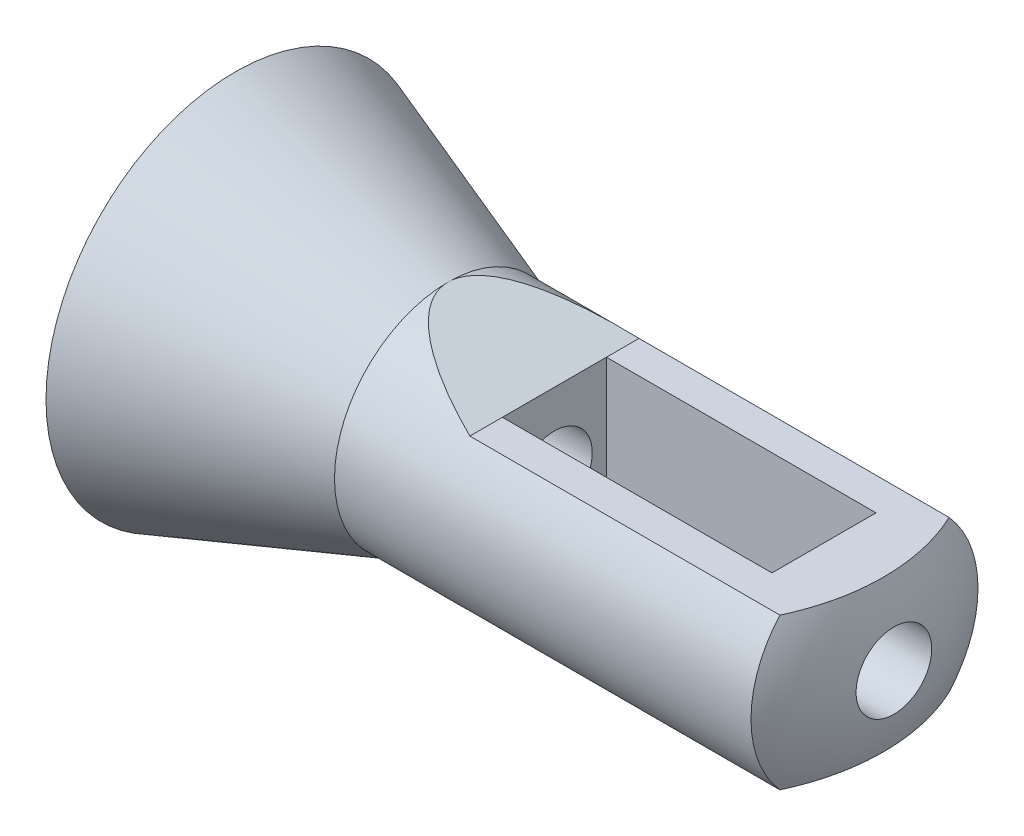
ISO-10303-21;
HEADER;
FILE_DESCRIPTION(('STEP AP214'),'2;1');
FILE_NAME('part.step','',(''),(''),'','','');
FILE_SCHEMA(('AUTOMOTIVE_DESIGN { 1 0 10303 214 1 1 1 1 }'));
ENDSEC;
DATA;
#1=APPLICATION_CONTEXT('core data for automotive mechanical design processes');
#2=APPLICATION_PROTOCOL_DEFINITION('international standard','automotive_design',2000,#1);
#3=PRODUCT_CONTEXT('',#1,'mechanical');
#4=PRODUCT('Part','Part','',(#3));
#5=PRODUCT_RELATED_PRODUCT_CATEGORY('part','',(#4));
#6=PRODUCT_DEFINITION_FORMATION('','',#4);
#7=PRODUCT_DEFINITION_CONTEXT('part definition',#1,'design');
#8=PRODUCT_DEFINITION('design','',#6,#7);
#9=PRODUCT_DEFINITION_SHAPE('','',#8);
#10=(LENGTH_UNIT() NAMED_UNIT(*) SI_UNIT(.MILLI.,.METRE.));
#11=(NAMED_UNIT(*) PLANE_ANGLE_UNIT() SI_UNIT($,.RADIAN.));
#12=(NAMED_UNIT(*) SI_UNIT($,.STERADIAN.) SOLID_ANGLE_UNIT());
#13=UNCERTAINTY_MEASURE_WITH_UNIT(LENGTH_MEASURE(1.E-05),#10,'distance_accuracy_value','');
#14=(GEOMETRIC_REPRESENTATION_CONTEXT(3) GLOBAL_UNCERTAINTY_ASSIGNED_CONTEXT((#13)) GLOBAL_UNIT_ASSIGNED_CONTEXT((#10,
#11,#12)) REPRESENTATION_CONTEXT('',''));
#15=CARTESIAN_POINT('',(0.,0.,0.));
#16=DIRECTION('',(0.,0.,1.));
#17=DIRECTION('',(1.,0.,0.));
#18=AXIS2_PLACEMENT_3D('',#15,#16,#17);
#19=CARTESIAN_POINT('',(0.,0.,0.));
#20=DIRECTION('',(-1.,0.,0.));
#21=DIRECTION('',(0.,0.,1.));
#22=AXIS2_PLACEMENT_3D('',#19,#20,#21);
#23=CYLINDRICAL_SURFACE('',#22,8.00000000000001);
#24=CARTESIAN_POINT('',(67.5,0.,0.));
#25=DIRECTION('',(-1.,0.,0.));
#26=DIRECTION('',(0.,0.,1.));
#27=AXIS2_PLACEMENT_3D('',#24,#25,#26);
#28=CIRCLE('',#27,8.00000000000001);
#29=CARTESIAN_POINT('',(67.5,0.,8.00000000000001));
#30=VERTEX_POINT('',#29);
#31=EDGE_CURVE('E135',#30,#30,#28,.T.);
#32=ORIENTED_EDGE('',*,*,#31,.F.);
#33=EDGE_LOOP('',(#32));
#34=FACE_BOUND('',#33,.T.);
#35=CARTESIAN_POINT('',(42.2401842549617,0.,0.));
#36=DIRECTION('',(-1.,0.,0.));
#37=DIRECTION('',(0.,0.,1.));
#38=AXIS2_PLACEMENT_3D('',#35,#36,#37);
#39=CIRCLE('',#38,8.00000000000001);
#40=CARTESIAN_POINT('',(42.2401842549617,0.,8.00000000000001));
#41=VERTEX_POINT('',#40);
#42=EDGE_CURVE('E142',#41,#41,#39,.T.);
#43=ORIENTED_EDGE('',*,*,#42,.T.);
#44=EDGE_LOOP('',(#43));
#45=FACE_BOUND('',#44,.T.);
#46=ADVANCED_FACE('F32',(#34,#45),#23,.F.);
#47=CARTESIAN_POINT('',(95.,0.,0.));
#48=DIRECTION('',(-1.,0.,0.));
#49=DIRECTION('',(0.,0.,-1.));
#50=AXIS2_PLACEMENT_3D('',#47,#48,#49);
#51=SPHERICAL_SURFACE('',#50,45.);
#52=CARTESIAN_POINT('',(95.,-16.,0.));
#53=DIRECTION('',(0.,1.,0.));
#54=DIRECTION('',(0.,0.,1.));
#55=AXIS2_PLACEMENT_3D('',#52,#53,#54);
#56=CIRCLE('',#55,42.0594816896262);
#57=CARTESIAN_POINT('',(133.065732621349,-16.,17.8885438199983));
#58=VERTEX_POINT('',#57);
#59=CARTESIAN_POINT('',(133.065732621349,-16.,-17.8885438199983));
#60=VERTEX_POINT('',#59);
#61=EDGE_CURVE('E186',#58,#60,#56,.T.);
#62=ORIENTED_EDGE('',*,*,#61,.T.);
#63=CARTESIAN_POINT('',(133.065732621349,0.,0.));
#64=DIRECTION('',(-1.,0.,0.));
#65=DIRECTION('',(0.,0.,1.));
#66=AXIS2_PLACEMENT_3D('',#63,#64,#65);
#67=CIRCLE('',#66,24.);
#68=CARTESIAN_POINT('',(133.065732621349,16.,-17.8885438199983));
#69=VERTEX_POINT('',#68);
#70=EDGE_CURVE('E170',#69,#60,#67,.T.);
#71=ORIENTED_EDGE('',*,*,#70,.F.);
#72=CARTESIAN_POINT('',(95.,16.,0.));
#73=DIRECTION('',(0.,1.,0.));
#74=DIRECTION('',(0.,0.,1.));
#75=AXIS2_PLACEMENT_3D('',#72,#73,#74);
#76=CIRCLE('',#75,42.0594816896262);
#77=CARTESIAN_POINT('',(133.065732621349,16.,17.8885438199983));
#78=VERTEX_POINT('',#77);
#79=EDGE_CURVE('E180',#78,#69,#76,.T.);
#80=ORIENTED_EDGE('',*,*,#79,.F.);
#81=EDGE_CURVE('E169',#58,#78,#67,.T.);
#82=ORIENTED_EDGE('',*,*,#81,.F.);
#83=EDGE_LOOP('',(#62,#71,#80,#82));
#84=FACE_BOUND('',#83,.T.);
#85=CARTESIAN_POINT('',(139.283179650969,0.,0.));
#86=DIRECTION('',(-1.,0.,0.));
#87=DIRECTION('',(0.,0.,1.));
#88=AXIS2_PLACEMENT_3D('',#85,#86,#87);
#89=CIRCLE('',#88,8.00000000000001);
#90=CARTESIAN_POINT('',(139.283179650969,0.,8.00000000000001));
#91=VERTEX_POINT('',#90);
#92=EDGE_CURVE('E145',#91,#91,#89,.F.);
#93=ORIENTED_EDGE('',*,*,#92,.F.);
#94=EDGE_LOOP('',(#93));
#95=FACE_BOUND('',#94,.T.);
#96=ADVANCED_FACE('F215',(#84,#95),#51,.T.);
#97=CARTESIAN_POINT('',(0.,0.,0.));
#98=DIRECTION('',(1.,0.,0.));
#99=DIRECTION('',(0.,0.,-1.));
#100=AXIS2_PLACEMENT_3D('',#97,#98,#99);
#101=PLANE('',#100);
#102=CARTESIAN_POINT('',(0.,0.,0.));
#103=DIRECTION('',(-1.,0.,0.));
#104=DIRECTION('',(0.,0.,1.));
#105=AXIS2_PLACEMENT_3D('',#102,#103,#104);
#106=CIRCLE('',#105,40.);
#107=CARTESIAN_POINT('',(0.,0.,40.));
#108=VERTEX_POINT('',#107);
#109=EDGE_CURVE('E177',#108,#108,#106,.T.);
#110=ORIENTED_EDGE('',*,*,#109,.T.);
#111=EDGE_LOOP('',(#110));
#112=FACE_BOUND('',#111,.T.);
#113=CARTESIAN_POINT('',(0.,0.,0.));
#114=DIRECTION('',(-1.,0.,0.));
#115=DIRECTION('',(0.,0.,1.));
#116=AXIS2_PLACEMENT_3D('',#113,#114,#115);
#117=CIRCLE('',#116,23.018732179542);
#118=CARTESIAN_POINT('',(0.,0.,23.018732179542));
#119=VERTEX_POINT('',#118);
#120=EDGE_CURVE('E139',#119,#119,#117,.T.);
#121=ORIENTED_EDGE('',*,*,#120,.F.);
#122=EDGE_LOOP('',(#121));
#123=FACE_BOUND('',#122,.T.);
#124=ADVANCED_FACE('F34',(#112,#123),#101,.F.);
#125=CARTESIAN_POINT('',(0.,0.,0.));
#126=DIRECTION('',(-1.,0.,0.));
#127=DIRECTION('',(0.,0.,1.));
#128=AXIS2_PLACEMENT_3D('',#125,#126,#127);
#129=CYLINDRICAL_SURFACE('',#128,24.);
#130=ORIENTED_EDGE('',*,*,#70,.T.);
#131=DIRECTION('',(-1.,0.,0.));
#132=VECTOR('',#131,1.);
#133=CARTESIAN_POINT('',(0.,-16.,-17.8885438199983));
#134=LINE('',#133,#132);
#135=CARTESIAN_POINT('',(67.5,-16.,-17.8885438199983));
#136=VERTEX_POINT('',#135);
#137=EDGE_CURVE('E157',#60,#136,#134,.T.);
#138=ORIENTED_EDGE('',*,*,#137,.T.);
#139=CARTESIAN_POINT('',(112.5,0.,0.));
#140=DIRECTION('',(-0.335009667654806,0.942214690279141,0.));
#141=DIRECTION('',(-0.942214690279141,-0.335009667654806,0.));
#142=AXIS2_PLACEMENT_3D('',#139,#140,#141);
#143=ELLIPSE('',#142,71.6397236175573,24.);
#144=CARTESIAN_POINT('',(45.,-24.,0.));
#145=VERTEX_POINT('',#144);
#146=EDGE_CURVE('E149',#136,#145,#143,.T.);
#147=ORIENTED_EDGE('',*,*,#146,.T.);
#148=CARTESIAN_POINT('',(45.,0.,0.));
#149=DIRECTION('',(-1.,0.,0.));
#150=DIRECTION('',(0.,0.,1.));
#151=AXIS2_PLACEMENT_3D('',#148,#149,#150);
#152=CIRCLE('',#151,24.);
#153=CARTESIAN_POINT('',(45.,24.,0.));
#154=VERTEX_POINT('',#153);
#155=EDGE_CURVE('E174',#154,#145,#152,.T.);
#156=ORIENTED_EDGE('',*,*,#155,.F.);
#157=CARTESIAN_POINT('',(112.5,0.,0.));
#158=DIRECTION('',(0.335009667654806,0.942214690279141,0.));
#159=DIRECTION('',(-0.942214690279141,0.335009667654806,0.));
#160=AXIS2_PLACEMENT_3D('',#157,#158,#159);
#161=ELLIPSE('',#160,71.6397236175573,24.);
#162=CARTESIAN_POINT('',(67.5,16.,-17.8885438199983));
#163=VERTEX_POINT('',#162);
#164=EDGE_CURVE('E185',#163,#154,#161,.T.);
#165=ORIENTED_EDGE('',*,*,#164,.F.);
#166=DIRECTION('',(-1.,0.,0.));
#167=VECTOR('',#166,1.);
#168=CARTESIAN_POINT('',(0.,16.,-17.8885438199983));
#169=LINE('',#168,#167);
#170=EDGE_CURVE('E166',#69,#163,#169,.T.);
#171=ORIENTED_EDGE('',*,*,#170,.F.);
#172=EDGE_LOOP('',(#130,#138,#147,#156,#165,#171));
#173=FACE_BOUND('',#172,.T.);
#174=ADVANCED_FACE('F209',(#173),#129,.T.);
#175=EDGE_CURVE('E173',#145,#154,#152,.T.);
#176=ORIENTED_EDGE('',*,*,#175,.F.);
#177=CARTESIAN_POINT('',(67.5,-16.,17.8885438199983));
#178=VERTEX_POINT('',#177);
#179=EDGE_CURVE('E153',#145,#178,#143,.T.);
#180=ORIENTED_EDGE('',*,*,#179,.T.);
#181=DIRECTION('',(-1.,0.,0.));
#182=VECTOR('',#181,1.);
#183=CARTESIAN_POINT('',(0.,-16.,17.8885438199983));
#184=LINE('',#183,#182);
#185=EDGE_CURVE('E154',#178,#58,#184,.F.);
#186=ORIENTED_EDGE('',*,*,#185,.T.);
#187=ORIENTED_EDGE('',*,*,#81,.T.);
#188=DIRECTION('',(-1.,0.,0.));
#189=VECTOR('',#188,1.);
#190=CARTESIAN_POINT('',(0.,16.,17.8885438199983));
#191=LINE('',#190,#189);
#192=CARTESIAN_POINT('',(67.5,16.,17.8885438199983));
#193=VERTEX_POINT('',#192);
#194=EDGE_CURVE('E163',#193,#78,#191,.F.);
#195=ORIENTED_EDGE('',*,*,#194,.F.);
#196=EDGE_CURVE('E182',#154,#193,#161,.T.);
#197=ORIENTED_EDGE('',*,*,#196,.F.);
#198=EDGE_LOOP('',(#176,#180,#186,#187,#195,#197));
#199=FACE_BOUND('',#198,.T.);
#200=ADVANCED_FACE('F219',(#199),#129,.T.);
#201=CARTESIAN_POINT('',(45.,0.,0.));
#202=DIRECTION('',(-1.,0.,0.));
#203=DIRECTION('',(0.,0.,1.));
#204=AXIS2_PLACEMENT_3D('',#201,#202,#203);
#205=CONICAL_SURFACE('',#204,24.,0.341615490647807);
#206=ORIENTED_EDGE('',*,*,#109,.F.);
#207=EDGE_LOOP('',(#206));
#208=FACE_BOUND('',#207,.T.);
#209=ORIENTED_EDGE('',*,*,#155,.T.);
#210=ORIENTED_EDGE('',*,*,#175,.T.);
#211=EDGE_LOOP('',(#209,#210));
#212=FACE_BOUND('',#211,.T.);
#213=ADVANCED_FACE('F222',(#208,#212),#205,.T.);
#214=CARTESIAN_POINT('',(67.5,16.,275.));
#215=DIRECTION('',(0.335009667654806,0.942214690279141,0.));
#216=DIRECTION('',(-0.942214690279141,0.335009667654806,0.));
#217=AXIS2_PLACEMENT_3D('',#214,#215,#216);
#218=PLANE('',#217);
#219=ORIENTED_EDGE('',*,*,#164,.T.);
#220=ORIENTED_EDGE('',*,*,#196,.T.);
#221=DIRECTION('',(0.,0.,-1.));
#222=VECTOR('',#221,1.);
#223=CARTESIAN_POINT('',(67.5,16.,275.));
#224=LINE('',#223,#222);
#225=CARTESIAN_POINT('',(67.5,16.,11.));
#226=VERTEX_POINT('',#225);
#227=EDGE_CURVE('E161',#193,#226,#224,.T.);
#228=ORIENTED_EDGE('',*,*,#227,.T.);
#229=DIRECTION('',(0.,0.,1.));
#230=VECTOR('',#229,1.);
#231=CARTESIAN_POINT('',(67.5,16.,-11.));
#232=LINE('',#231,#230);
#233=CARTESIAN_POINT('',(67.5,16.,-11.));
#234=VERTEX_POINT('',#233);
#235=EDGE_CURVE('E47',#234,#226,#232,.T.);
#236=ORIENTED_EDGE('',*,*,#235,.F.);
#237=EDGE_CURVE('E160',#234,#163,#224,.T.);
#238=ORIENTED_EDGE('',*,*,#237,.T.);
#239=EDGE_LOOP('',(#219,#220,#228,#236,#238));
#240=FACE_BOUND('',#239,.T.);
#241=ADVANCED_FACE('F225',(#240),#218,.T.);
#242=CARTESIAN_POINT('',(67.5,16.,275.));
#243=DIRECTION('',(0.,1.,0.));
#244=DIRECTION('',(0.,0.,1.));
#245=AXIS2_PLACEMENT_3D('',#242,#243,#244);
#246=PLANE('',#245);
#247=DIRECTION('',(-1.,0.,0.));
#248=VECTOR('',#247,1.);
#249=CARTESIAN_POINT('',(67.5,16.,-11.));
#250=LINE('',#249,#248);
#251=CARTESIAN_POINT('',(124.5,16.,-11.));
#252=VERTEX_POINT('',#251);
#253=EDGE_CURVE('E124',#252,#234,#250,.T.);
#254=ORIENTED_EDGE('',*,*,#253,.F.);
#255=DIRECTION('',(0.,0.,-1.));
#256=VECTOR('',#255,1.);
#257=CARTESIAN_POINT('',(124.5,16.,-11.));
#258=LINE('',#257,#256);
#259=CARTESIAN_POINT('',(124.5,16.,11.));
#260=VERTEX_POINT('',#259);
#261=EDGE_CURVE('E106',#260,#252,#258,.T.);
#262=ORIENTED_EDGE('',*,*,#261,.F.);
#263=DIRECTION('',(1.,0.,0.));
#264=VECTOR('',#263,1.);
#265=CARTESIAN_POINT('',(67.5,16.,11.));
#266=LINE('',#265,#264);
#267=EDGE_CURVE('E115',#226,#260,#266,.T.);
#268=ORIENTED_EDGE('',*,*,#267,.F.);
#269=ORIENTED_EDGE('',*,*,#227,.F.);
#270=ORIENTED_EDGE('',*,*,#194,.T.);
#271=ORIENTED_EDGE('',*,*,#79,.T.);
#272=ORIENTED_EDGE('',*,*,#170,.T.);
#273=ORIENTED_EDGE('',*,*,#237,.F.);
#274=EDGE_LOOP('',(#254,#262,#268,#269,#270,#271,#272,#273));
#275=FACE_BOUND('',#274,.T.);
#276=ADVANCED_FACE('F121',(#275),#246,.T.);
#277=CARTESIAN_POINT('',(67.5,-16.,247.360679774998));
#278=DIRECTION('',(0.,1.,0.));
#279=DIRECTION('',(0.,0.,1.));
#280=AXIS2_PLACEMENT_3D('',#277,#278,#279);
#281=PLANE('',#280);
#282=DIRECTION('',(0.,0.,-1.));
#283=VECTOR('',#282,1.);
#284=CARTESIAN_POINT('',(124.5,-16.,247.360679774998));
#285=LINE('',#284,#283);
#286=CARTESIAN_POINT('',(124.5,-16.,11.));
#287=VERTEX_POINT('',#286);
#288=CARTESIAN_POINT('',(124.5,-16.,-11.));
#289=VERTEX_POINT('',#288);
#290=EDGE_CURVE('E109',#287,#289,#285,.T.);
#291=ORIENTED_EDGE('',*,*,#290,.T.);
#292=DIRECTION('',(-1.,0.,0.));
#293=VECTOR('',#292,1.);
#294=CARTESIAN_POINT('',(67.5,-16.,-11.));
#295=LINE('',#294,#293);
#296=CARTESIAN_POINT('',(67.5,-16.,-11.));
#297=VERTEX_POINT('',#296);
#298=EDGE_CURVE('E11',#289,#297,#295,.T.);
#299=ORIENTED_EDGE('',*,*,#298,.T.);
#300=DIRECTION('',(0.,0.,-1.));
#301=VECTOR('',#300,1.);
#302=CARTESIAN_POINT('',(67.5,-16.,247.360679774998));
#303=LINE('',#302,#301);
#304=EDGE_CURVE('E150',#297,#136,#303,.T.);
#305=ORIENTED_EDGE('',*,*,#304,.T.);
#306=ORIENTED_EDGE('',*,*,#137,.F.);
#307=ORIENTED_EDGE('',*,*,#61,.F.);
#308=ORIENTED_EDGE('',*,*,#185,.F.);
#309=CARTESIAN_POINT('',(67.5,-16.,11.));
#310=VERTEX_POINT('',#309);
#311=EDGE_CURVE('E146',#178,#310,#303,.T.);
#312=ORIENTED_EDGE('',*,*,#311,.T.);
#313=DIRECTION('',(1.,0.,0.));
#314=VECTOR('',#313,1.);
#315=CARTESIAN_POINT('',(67.5,-16.,11.));
#316=LINE('',#315,#314);
#317=EDGE_CURVE('E40',#310,#287,#316,.T.);
#318=ORIENTED_EDGE('',*,*,#317,.T.);
#319=EDGE_LOOP('',(#291,#299,#305,#306,#307,#308,#312,#318));
#320=FACE_BOUND('',#319,.T.);
#321=ADVANCED_FACE('F194',(#320),#281,.F.);
#322=CARTESIAN_POINT('',(67.5,-16.,247.360679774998));
#323=DIRECTION('',(-0.335009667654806,0.942214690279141,0.));
#324=DIRECTION('',(-0.942214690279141,-0.335009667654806,0.));
#325=AXIS2_PLACEMENT_3D('',#322,#323,#324);
#326=PLANE('',#325);
#327=ORIENTED_EDGE('',*,*,#179,.F.);
#328=ORIENTED_EDGE('',*,*,#146,.F.);
#329=ORIENTED_EDGE('',*,*,#304,.F.);
#330=DIRECTION('',(0.,0.,1.));
#331=VECTOR('',#330,1.);
#332=CARTESIAN_POINT('',(67.5,-16.,247.360679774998));
#333=LINE('',#332,#331);
#334=EDGE_CURVE('E136',#297,#310,#333,.T.);
#335=ORIENTED_EDGE('',*,*,#334,.T.);
#336=ORIENTED_EDGE('',*,*,#311,.F.);
#337=EDGE_LOOP('',(#327,#328,#329,#335,#336));
#338=FACE_BOUND('',#337,.T.);
#339=ADVANCED_FACE('F198',(#338),#326,.F.);
#340=CARTESIAN_POINT('',(124.5,0.,0.));
#341=DIRECTION('',(1.,0.,0.));
#342=DIRECTION('',(0.,0.,-1.));
#343=AXIS2_PLACEMENT_3D('',#340,#341,#342);
#344=CIRCLE('',#343,8.00000000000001);
#345=CARTESIAN_POINT('',(124.5,0.,-8.00000000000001));
#346=VERTEX_POINT('',#345);
#347=EDGE_CURVE('E131',#346,#346,#344,.T.);
#348=ORIENTED_EDGE('',*,*,#347,.F.);
#349=EDGE_LOOP('',(#348));
#350=FACE_BOUND('',#349,.T.);
#351=ORIENTED_EDGE('',*,*,#92,.T.);
#352=EDGE_LOOP('',(#351));
#353=FACE_BOUND('',#352,.T.);
#354=ADVANCED_FACE('F238',(#350,#353),#23,.F.);
#355=CARTESIAN_POINT('',(42.2401842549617,0.,0.));
#356=DIRECTION('',(-1.,0.,0.));
#357=DIRECTION('',(0.,0.,1.));
#358=AXIS2_PLACEMENT_3D('',#355,#356,#357);
#359=CONICAL_SURFACE('',#358,8.00000000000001,0.341615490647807);
#360=ORIENTED_EDGE('',*,*,#120,.T.);
#361=EDGE_LOOP('',(#360));
#362=FACE_BOUND('',#361,.T.);
#363=ORIENTED_EDGE('',*,*,#42,.F.);
#364=EDGE_LOOP('',(#363));
#365=FACE_BOUND('',#364,.T.);
#366=ADVANCED_FACE('F247',(#362,#365),#359,.F.);
#367=CARTESIAN_POINT('',(67.5,-40.,-11.));
#368=DIRECTION('',(0.,0.,-1.));
#369=DIRECTION('',(-1.,0.,0.));
#370=AXIS2_PLACEMENT_3D('',#367,#368,#369);
#371=PLANE('',#370);
#372=DIRECTION('',(0.,1.,0.));
#373=VECTOR('',#372,1.);
#374=CARTESIAN_POINT('',(124.5,-40.,-11.));
#375=LINE('',#374,#373);
#376=EDGE_CURVE('E112',#289,#252,#375,.T.);
#377=ORIENTED_EDGE('',*,*,#376,.T.);
#378=ORIENTED_EDGE('',*,*,#253,.T.);
#379=DIRECTION('',(0.,1.,0.));
#380=VECTOR('',#379,1.);
#381=CARTESIAN_POINT('',(67.5,-40.,-11.));
#382=LINE('',#381,#380);
#383=EDGE_CURVE('E129',#297,#234,#382,.T.);
#384=ORIENTED_EDGE('',*,*,#383,.F.);
#385=ORIENTED_EDGE('',*,*,#298,.F.);
#386=EDGE_LOOP('',(#377,#378,#384,#385));
#387=FACE_BOUND('',#386,.T.);
#388=ADVANCED_FACE('F204',(#387),#371,.F.);
#389=CARTESIAN_POINT('',(67.5,-40.,11.));
#390=DIRECTION('',(0.,0.,1.));
#391=DIRECTION('',(1.,0.,0.));
#392=AXIS2_PLACEMENT_3D('',#389,#390,#391);
#393=PLANE('',#392);
#394=DIRECTION('',(0.,1.,0.));
#395=VECTOR('',#394,1.);
#396=CARTESIAN_POINT('',(67.5,-40.,11.));
#397=LINE('',#396,#395);
#398=EDGE_CURVE('E51',#310,#226,#397,.T.);
#399=ORIENTED_EDGE('',*,*,#398,.T.);
#400=ORIENTED_EDGE('',*,*,#267,.T.);
#401=DIRECTION('',(0.,1.,0.));
#402=VECTOR('',#401,1.);
#403=CARTESIAN_POINT('',(124.5,-40.,11.));
#404=LINE('',#403,#402);
#405=EDGE_CURVE('E101',#287,#260,#404,.T.);
#406=ORIENTED_EDGE('',*,*,#405,.F.);
#407=ORIENTED_EDGE('',*,*,#317,.F.);
#408=EDGE_LOOP('',(#399,#400,#406,#407));
#409=FACE_BOUND('',#408,.T.);
#410=ADVANCED_FACE('F116',(#409),#393,.F.);
#411=CARTESIAN_POINT('',(67.5,-40.,-11.));
#412=DIRECTION('',(-1.,0.,0.));
#413=DIRECTION('',(0.,0.,1.));
#414=AXIS2_PLACEMENT_3D('',#411,#412,#413);
#415=PLANE('',#414);
#416=ORIENTED_EDGE('',*,*,#31,.T.);
#417=EDGE_LOOP('',(#416));
#418=FACE_BOUND('',#417,.T.);
#419=ORIENTED_EDGE('',*,*,#383,.T.);
#420=ORIENTED_EDGE('',*,*,#235,.T.);
#421=ORIENTED_EDGE('',*,*,#398,.F.);
#422=ORIENTED_EDGE('',*,*,#334,.F.);
#423=EDGE_LOOP('',(#419,#420,#421,#422));
#424=FACE_BOUND('',#423,.T.);
#425=ADVANCED_FACE('F202',(#418,#424),#415,.F.);
#426=CARTESIAN_POINT('',(124.5,-40.,-11.));
#427=DIRECTION('',(1.,0.,0.));
#428=DIRECTION('',(0.,0.,-1.));
#429=AXIS2_PLACEMENT_3D('',#426,#427,#428);
#430=PLANE('',#429);
#431=ORIENTED_EDGE('',*,*,#347,.T.);
#432=EDGE_LOOP('',(#431));
#433=FACE_BOUND('',#432,.T.);
#434=ORIENTED_EDGE('',*,*,#405,.T.);
#435=ORIENTED_EDGE('',*,*,#261,.T.);
#436=ORIENTED_EDGE('',*,*,#376,.F.);
#437=ORIENTED_EDGE('',*,*,#290,.F.);
#438=EDGE_LOOP('',(#434,#435,#436,#437));
#439=FACE_BOUND('',#438,.T.);
#440=ADVANCED_FACE('F103',(#433,#439),#430,.F.);
#441=CLOSED_SHELL('',(#46,#96,#124,#174,#200,#213,#241,#276,#321,#339,#354,#366,#388,#410,#425,#440));
#442=MANIFOLD_SOLID_BREP('B2',#441);
#443=ADVANCED_BREP_SHAPE_REPRESENTATION('',(#18,#442),#14);
#444=SHAPE_DEFINITION_REPRESENTATION(#9,#443);
ENDSEC;
END-ISO-10303-21;
